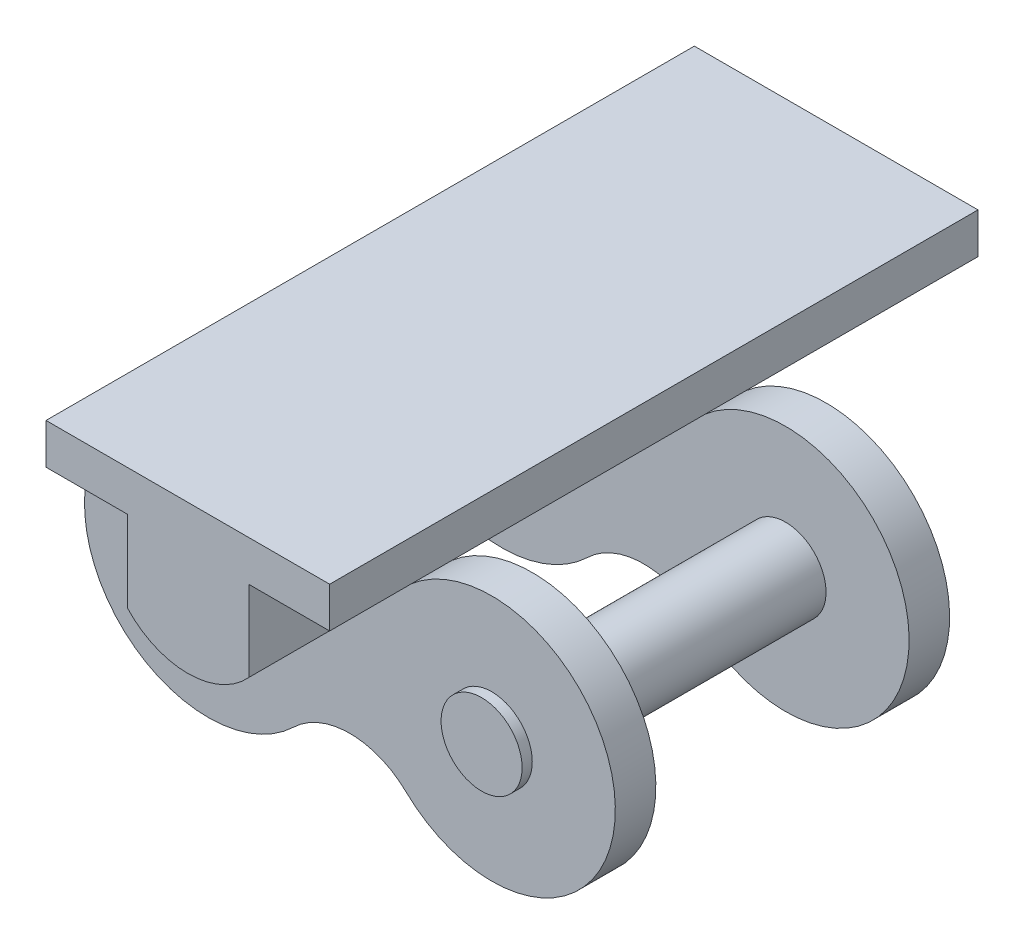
from build123d import *

# Parameters (mm, degrees)
CROQUIS1_R                   = 2
SALIENTE_EXTRUIR1_DEPTH      = 2
SALIENTE_EXTRUIR2_DEPTH      = 15
SALIENTE_EXTRUIR2_DEPTH_BACK = 2.5
CROQUIS2_R                   = 2
SALIENTE_EXTRUIR3_DEPTH      = 8
SALIENTE_EXTRUIR3_DEPTH_BACK = 24


with BuildPart() as part:
    # Croquis1 → Saliente-Extruir1 (new body)
    with BuildSketch(Plane.XY):
        with BuildLine():
            ThreePointArc((-2.772277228, 4.397312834), (-13.1, 0), (-2.772277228, -4.397312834))
            ThreePointArc((-2.772277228, -4.397312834), (0, -3.28079666), (2.772277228, -4.397312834))
            ThreePointArc((2.772277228, -4.397312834), (13.1, 0), (2.772277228, 4.397312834))
            ThreePointArc((2.772277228, 4.397312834), (0, 3.28079666), (-2.772277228, 4.397312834))
        make_face()
        with Locations((-7, 0)):
            Circle(CROQUIS1_R, mode=Mode.SUBTRACT)
        with Locations(Location((7, 0, 0), (0, 0, 180))):
            Circle(CROQUIS1_R, mode=Mode.SUBTRACT)
    saliente_extruir1 = extrude(amount=SALIENTE_EXTRUIR1_DEPTH)

    # Croquis2 → Saliente-Extruir2 (add, two sides: drawn at the far end of the back side and taken through both)
    with BuildSketch(Plane.XY.offset(2).offset(-SALIENTE_EXTRUIR2_DEPTH_BACK)):
        with Locations((7, 0)):
            Circle(CROQUIS2_R)
        with Locations((-7, 0)):
            Circle(CROQUIS2_R)
    extrude(amount=SALIENTE_EXTRUIR2_DEPTH + SALIENTE_EXTRUIR2_DEPTH_BACK)

    # Simetr_a1: Saliente-Extruir1 across plane
    add(saliente_extruir1.mirror(Plane.XY.offset(8.25)))

    # Croquis3 → Saliente-Extruir3 (add, two sides: drawn at the far end of the back side and taken through both)
    with BuildSketch(Plane.XY.offset(16.5).offset(-SALIENTE_EXTRUIR3_DEPTH_BACK)):
        with BuildLine():
            Line((-2.989568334, 4.596350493), (-2.989568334, 8.596350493))
            Line((-2.989568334, 8.596350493), (-7, 8.596350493))
            Line((-7, 8.596350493), (-7, 10.596350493))
            Line((-7, 10.596350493), (7, 10.596350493))
            Line((7, 10.596350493), (7, 8.596350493))
            Line((7, 8.596350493), (3.010431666, 8.596350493))
            Line((3.010431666, 8.596350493), (3.010431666, 4.614471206))
            ThreePointArc((3.010431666, 4.614471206), (0.014432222, 3.280775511), (-2.989568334, 4.596350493))
        make_face()
    extrude(amount=SALIENTE_EXTRUIR3_DEPTH + SALIENTE_EXTRUIR3_DEPTH_BACK)


solid = part.part
